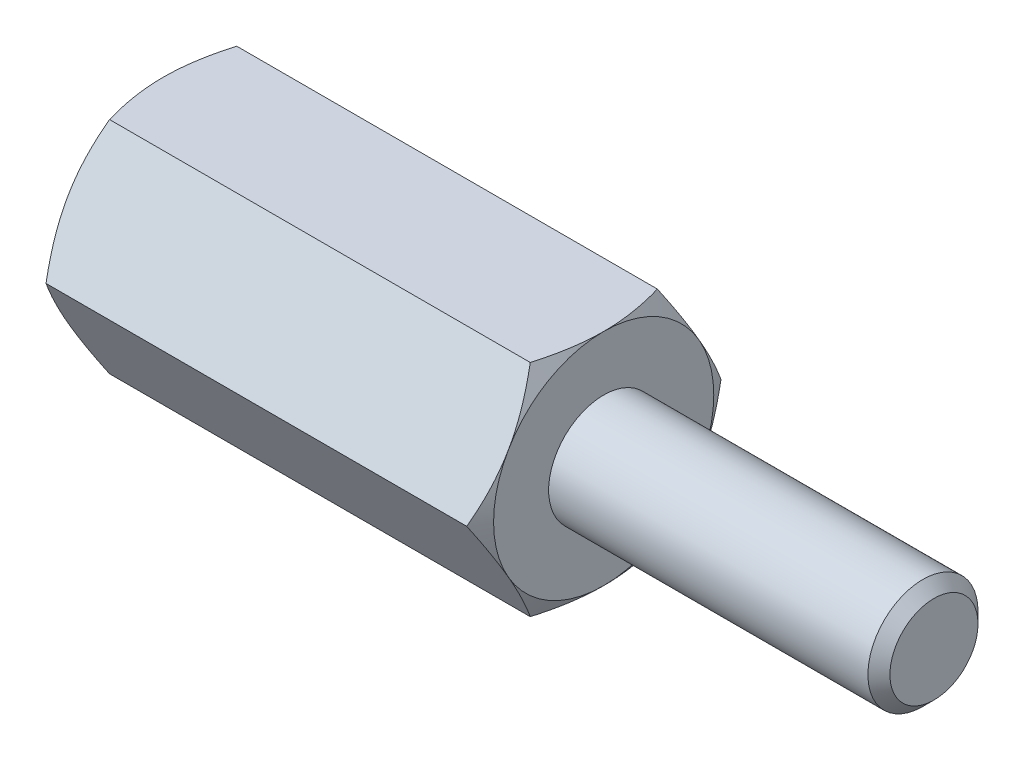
from build123d import *

# Parameters (mm, degrees)
EXTRUDE2_DEPTH = 4
SKETCH3_R      = 0.8
EXTRUDE3_DEPTH = 5
SKETCH5_R      = 1
EXTRUDE4_DEPTH = 6
CHAMFER1_SIZE  = 0.2


with BuildPart() as part:
    # Sketch1 → Extrude2 (new, symmetric)
    with BuildSketch(Plane(origin=(0, 0, 0), x_dir=(0, 0, -1), z_dir=(1, 0, 0))):
        Polygon((1.154700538, 2), (-1.154700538, 2), (-2.309401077, 0), (-1.154700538, -2), (1.154700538, -2), (2.309401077, 0), align=None)
    extrude(amount=EXTRUDE2_DEPTH, both=True)

    # Sketch2 → Cut-Revolve1 (revolve, cut)
    with BuildSketch(Plane.XY):
        with BuildLine():
            Line((-4, 2), (-2.5, 4.598076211))
            ThreePointArc((-2.5, 4.598076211), (-2.98810136, 5.776457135), (-4, 5))
            Line((-4, 5), (-4, 2))
        make_face()
    cut_revolve1 = revolve(axis=Axis((0, 0, 0), (1, 0, 0)), mode=Mode.SUBTRACT)

    # Mirror1: Cut-Revolve1 across plane
    add(cut_revolve1.mirror(Plane(origin=(0, 0, 0), x_dir=(0, 0, 1), z_dir=(1, 0, 0))), mode=Mode.SUBTRACT)

    # Sketch3 → Extrude3 (cut)
    with BuildSketch(Plane.ZY.offset(4)):
        Circle(SKETCH3_R)
    extrude(amount=-EXTRUDE3_DEPTH, mode=Mode.SUBTRACT)

    # Sketch4 → Cut-Revolve2 (revolve, cut)
    with BuildSketch(Plane.XY, mode=Mode.PRIVATE) as cut_revolve2_sk:
        Polygon((1, 0), (1, 0.8), (1.461880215, 0), align=None)
    revolve(cut_revolve2_sk.sketch.rotate(Axis((1.461880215, 0, 0), (-1, 0, 0)), 270), axis=Axis((1.461880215, 0, 0), (-1, 0, 0)), mode=Mode.SUBTRACT)

    # Sketch5 → Extrude4 (add)
    with BuildSketch(Plane(origin=(4, 0, 0), x_dir=(0, 0, -1), z_dir=(1, 0, 0))):
        Circle(SKETCH5_R)
    extrude(amount=EXTRUDE4_DEPTH)

    # Chamfer1
    chamfer1_edges = [part.edges().sort_by_distance(p)[0] for p in [
        (10, 0, 1),
    ]]
    chamfer(chamfer1_edges, length=CHAMFER1_SIZE)


solid = part.part
